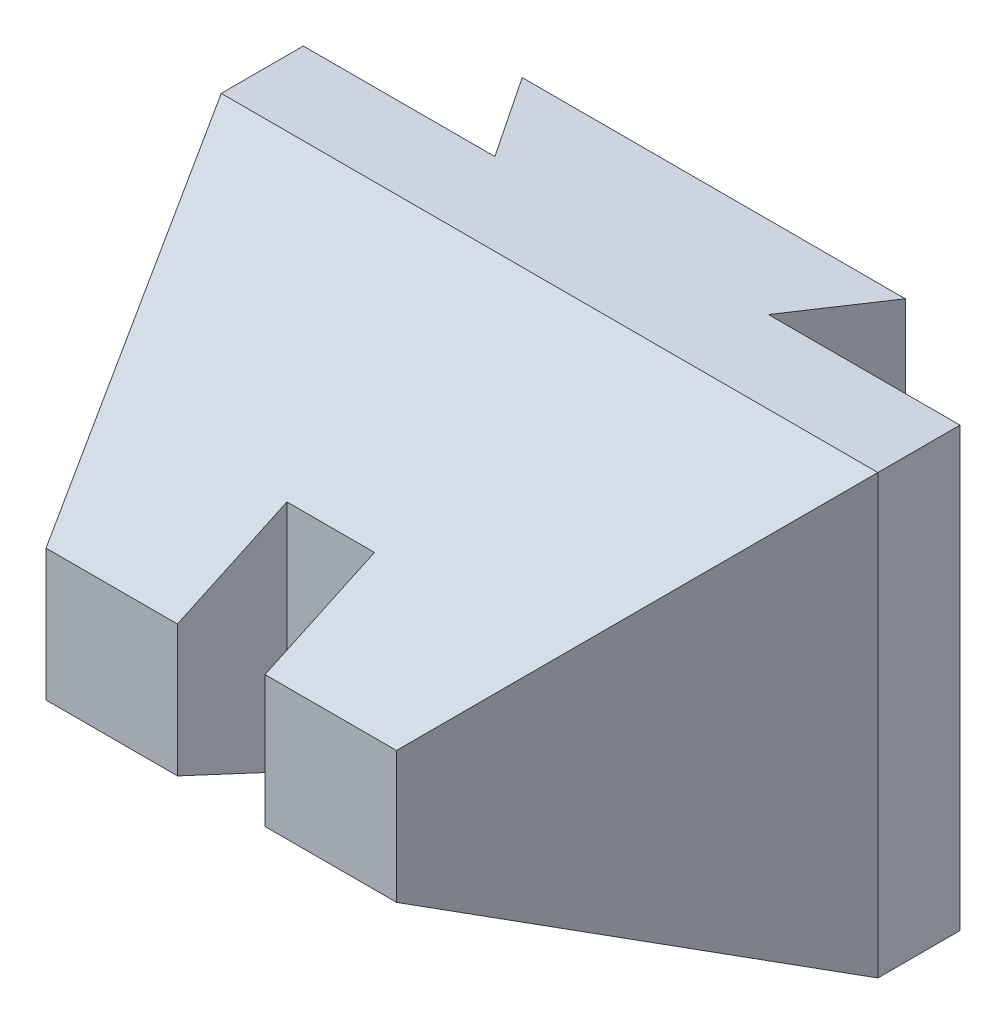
ISO-10303-21;
HEADER;
FILE_DESCRIPTION(('STEP AP214'),'2;1');
FILE_NAME('part.step','',(''),(''),'','','');
FILE_SCHEMA(('AUTOMOTIVE_DESIGN { 1 0 10303 214 1 1 1 1 }'));
ENDSEC;
DATA;
#1=APPLICATION_CONTEXT('core data for automotive mechanical design processes');
#2=APPLICATION_PROTOCOL_DEFINITION('international standard','automotive_design',2000,#1);
#3=PRODUCT_CONTEXT('',#1,'mechanical');
#4=PRODUCT('Part','Part','',(#3));
#5=PRODUCT_RELATED_PRODUCT_CATEGORY('part','',(#4));
#6=PRODUCT_DEFINITION_FORMATION('','',#4);
#7=PRODUCT_DEFINITION_CONTEXT('part definition',#1,'design');
#8=PRODUCT_DEFINITION('design','',#6,#7);
#9=PRODUCT_DEFINITION_SHAPE('','',#8);
#10=(LENGTH_UNIT() NAMED_UNIT(*) SI_UNIT(.MILLI.,.METRE.));
#11=(NAMED_UNIT(*) PLANE_ANGLE_UNIT() SI_UNIT($,.RADIAN.));
#12=(NAMED_UNIT(*) SI_UNIT($,.STERADIAN.) SOLID_ANGLE_UNIT());
#13=UNCERTAINTY_MEASURE_WITH_UNIT(LENGTH_MEASURE(1.E-05),#10,'distance_accuracy_value','');
#14=(GEOMETRIC_REPRESENTATION_CONTEXT(3) GLOBAL_UNCERTAINTY_ASSIGNED_CONTEXT((#13)) GLOBAL_UNIT_ASSIGNED_CONTEXT((#10,
#11,#12)) REPRESENTATION_CONTEXT('',''));
#15=CARTESIAN_POINT('',(0.,0.,0.));
#16=DIRECTION('',(0.,0.,1.));
#17=DIRECTION('',(1.,0.,0.));
#18=AXIS2_PLACEMENT_3D('',#15,#16,#17);
#19=CARTESIAN_POINT('',(-60.,-40.,60.));
#20=DIRECTION('',(0.,0.,1.));
#21=DIRECTION('',(1.,0.,0.));
#22=AXIS2_PLACEMENT_3D('',#19,#20,#21);
#23=PLANE('',#22);
#24=DIRECTION('',(0.,-1.,0.));
#25=VECTOR('',#24,1.);
#26=CARTESIAN_POINT('',(-8.00000000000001,-40.,60.));
#27=LINE('',#26,#25);
#28=CARTESIAN_POINT('',(-8.,12.0215405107,60.));
#29=VERTEX_POINT('',#28);
#30=CARTESIAN_POINT('',(-8.,-12.0215405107,60.));
#31=VERTEX_POINT('',#30);
#32=EDGE_CURVE('E39',#29,#31,#27,.T.);
#33=ORIENTED_EDGE('',*,*,#32,.F.);
#34=DIRECTION('',(1.,0.,0.));
#35=VECTOR('',#34,1.);
#36=CARTESIAN_POINT('',(-60.,12.0215405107,60.));
#37=LINE('',#36,#35);
#38=CARTESIAN_POINT('',(-32.0215405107,12.0215405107,60.));
#39=VERTEX_POINT('',#38);
#40=EDGE_CURVE('E155',#29,#39,#37,.F.);
#41=ORIENTED_EDGE('',*,*,#40,.T.);
#42=DIRECTION('',(0.,1.,0.));
#43=VECTOR('',#42,1.);
#44=CARTESIAN_POINT('',(-32.0215405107,40.,60.));
#45=LINE('',#44,#43);
#46=CARTESIAN_POINT('',(-32.0215405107,-12.0215405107,60.));
#47=VERTEX_POINT('',#46);
#48=EDGE_CURVE('E180',#39,#47,#45,.F.);
#49=ORIENTED_EDGE('',*,*,#48,.T.);
#50=DIRECTION('',(-1.,0.,0.));
#51=VECTOR('',#50,1.);
#52=CARTESIAN_POINT('',(-60.,-12.0215405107,60.));
#53=LINE('',#52,#51);
#54=EDGE_CURVE('E175',#47,#31,#53,.F.);
#55=ORIENTED_EDGE('',*,*,#54,.T.);
#56=EDGE_LOOP('',(#33,#41,#49,#55));
#57=FACE_BOUND('',#56,.T.);
#58=ADVANCED_FACE('F31',(#57),#23,.T.);
#59=CARTESIAN_POINT('',(60.,-40.,-30.));
#60=DIRECTION('',(0.,1.,0.));
#61=DIRECTION('',(-1.,0.,0.));
#62=AXIS2_PLACEMENT_3D('',#59,#60,#61);
#63=PLANE('',#62);
#64=DIRECTION('',(-1.,0.,0.));
#65=VECTOR('',#64,1.);
#66=CARTESIAN_POINT('',(60.,-40.0000000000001,-15.));
#67=LINE('',#66,#65);
#68=CARTESIAN_POINT('',(60.,-40.0000000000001,-15.));
#69=VERTEX_POINT('',#68);
#70=CARTESIAN_POINT('',(25.,-40.,-15.));
#71=VERTEX_POINT('',#70);
#72=EDGE_CURVE('E237',#69,#71,#67,.T.);
#73=ORIENTED_EDGE('',*,*,#72,.F.);
#74=DIRECTION('',(0.,0.,1.));
#75=VECTOR('',#74,1.);
#76=CARTESIAN_POINT('',(60.,-40.,-30.));
#77=LINE('',#76,#75);
#78=CARTESIAN_POINT('',(60.,-40.,0.));
#79=VERTEX_POINT('',#78);
#80=EDGE_CURVE('E208',#69,#79,#77,.T.);
#81=ORIENTED_EDGE('',*,*,#80,.T.);
#82=DIRECTION('',(1.,0.,0.));
#83=VECTOR('',#82,1.);
#84=CARTESIAN_POINT('',(-60.,-40.,0.));
#85=LINE('',#84,#83);
#86=CARTESIAN_POINT('',(-60.,-40.,0.));
#87=VERTEX_POINT('',#86);
#88=EDGE_CURVE('E196',#87,#79,#85,.T.);
#89=ORIENTED_EDGE('',*,*,#88,.F.);
#90=DIRECTION('',(0.,0.,1.));
#91=VECTOR('',#90,1.);
#92=CARTESIAN_POINT('',(-60.,-40.,-30.));
#93=LINE('',#92,#91);
#94=CARTESIAN_POINT('',(-60.,-40.,-15.));
#95=VERTEX_POINT('',#94);
#96=EDGE_CURVE('E202',#95,#87,#93,.T.);
#97=ORIENTED_EDGE('',*,*,#96,.F.);
#98=DIRECTION('',(1.,0.,0.));
#99=VECTOR('',#98,1.);
#100=CARTESIAN_POINT('',(-60.,-40.,-15.));
#101=LINE('',#100,#99);
#102=CARTESIAN_POINT('',(-25.,-40.,-15.));
#103=VERTEX_POINT('',#102);
#104=EDGE_CURVE('E225',#95,#103,#101,.T.);
#105=ORIENTED_EDGE('',*,*,#104,.T.);
#106=DIRECTION('',(-0.554700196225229,0.,-0.832050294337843));
#107=VECTOR('',#106,1.);
#108=CARTESIAN_POINT('',(-25.,-40.,-15.));
#109=LINE('',#108,#107);
#110=CARTESIAN_POINT('',(-35.,-40.,-30.));
#111=VERTEX_POINT('',#110);
#112=EDGE_CURVE('E219',#103,#111,#109,.T.);
#113=ORIENTED_EDGE('',*,*,#112,.T.);
#114=DIRECTION('',(-1.,0.,0.));
#115=VECTOR('',#114,1.);
#116=CARTESIAN_POINT('',(60.,-40.,-30.));
#117=LINE('',#116,#115);
#118=CARTESIAN_POINT('',(35.,-40.,-30.));
#119=VERTEX_POINT('',#118);
#120=EDGE_CURVE('E213',#119,#111,#117,.T.);
#121=ORIENTED_EDGE('',*,*,#120,.F.);
#122=DIRECTION('',(0.554700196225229,0.,-0.832050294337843));
#123=VECTOR('',#122,1.);
#124=CARTESIAN_POINT('',(25.,-40.,-15.));
#125=LINE('',#124,#123);
#126=EDGE_CURVE('E54',#71,#119,#125,.T.);
#127=ORIENTED_EDGE('',*,*,#126,.F.);
#128=EDGE_LOOP('',(#73,#81,#89,#97,#105,#113,#121,#127));
#129=FACE_BOUND('',#128,.T.);
#130=ADVANCED_FACE('F281',(#129),#63,.F.);
#131=CARTESIAN_POINT('',(-60.,40.,-30.));
#132=DIRECTION('',(0.,-1.,0.));
#133=DIRECTION('',(1.,0.,0.));
#134=AXIS2_PLACEMENT_3D('',#131,#132,#133);
#135=PLANE('',#134);
#136=DIRECTION('',(-1.,0.,0.));
#137=VECTOR('',#136,1.);
#138=CARTESIAN_POINT('',(60.,40.,-15.));
#139=LINE('',#138,#137);
#140=CARTESIAN_POINT('',(60.,40.,-15.));
#141=VERTEX_POINT('',#140);
#142=CARTESIAN_POINT('',(25.,40.,-15.));
#143=VERTEX_POINT('',#142);
#144=EDGE_CURVE('E241',#141,#143,#139,.T.);
#145=ORIENTED_EDGE('',*,*,#144,.T.);
#146=DIRECTION('',(0.554700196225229,0.,-0.832050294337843));
#147=VECTOR('',#146,1.);
#148=CARTESIAN_POINT('',(25.,40.,-15.));
#149=LINE('',#148,#147);
#150=CARTESIAN_POINT('',(35.,40.,-30.));
#151=VERTEX_POINT('',#150);
#152=EDGE_CURVE('E244',#143,#151,#149,.T.);
#153=ORIENTED_EDGE('',*,*,#152,.T.);
#154=DIRECTION('',(1.,0.,0.));
#155=VECTOR('',#154,1.);
#156=CARTESIAN_POINT('',(-60.,40.,-30.));
#157=LINE('',#156,#155);
#158=CARTESIAN_POINT('',(-35.,40.,-30.));
#159=VERTEX_POINT('',#158);
#160=EDGE_CURVE('E210',#159,#151,#157,.T.);
#161=ORIENTED_EDGE('',*,*,#160,.F.);
#162=DIRECTION('',(-0.554700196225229,0.,-0.832050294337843));
#163=VECTOR('',#162,1.);
#164=CARTESIAN_POINT('',(-25.,40.,-15.));
#165=LINE('',#164,#163);
#166=CARTESIAN_POINT('',(-25.,40.,-15.));
#167=VERTEX_POINT('',#166);
#168=EDGE_CURVE('E223',#167,#159,#165,.T.);
#169=ORIENTED_EDGE('',*,*,#168,.F.);
#170=DIRECTION('',(1.,0.,0.));
#171=VECTOR('',#170,1.);
#172=CARTESIAN_POINT('',(-60.,40.,-15.));
#173=LINE('',#172,#171);
#174=CARTESIAN_POINT('',(-60.,40.,-15.));
#175=VERTEX_POINT('',#174);
#176=EDGE_CURVE('E226',#175,#167,#173,.T.);
#177=ORIENTED_EDGE('',*,*,#176,.F.);
#178=DIRECTION('',(0.,0.,1.));
#179=VECTOR('',#178,1.);
#180=CARTESIAN_POINT('',(-60.,40.,-30.));
#181=LINE('',#180,#179);
#182=CARTESIAN_POINT('',(-60.,40.,0.));
#183=VERTEX_POINT('',#182);
#184=EDGE_CURVE('E204',#175,#183,#181,.T.);
#185=ORIENTED_EDGE('',*,*,#184,.T.);
#186=DIRECTION('',(-1.,0.,0.));
#187=VECTOR('',#186,1.);
#188=CARTESIAN_POINT('',(-60.,40.,0.));
#189=LINE('',#188,#187);
#190=CARTESIAN_POINT('',(60.,40.,0.));
#191=VERTEX_POINT('',#190);
#192=EDGE_CURVE('E185',#191,#183,#189,.T.);
#193=ORIENTED_EDGE('',*,*,#192,.F.);
#194=DIRECTION('',(0.,0.,1.));
#195=VECTOR('',#194,1.);
#196=CARTESIAN_POINT('',(60.,40.,-30.));
#197=LINE('',#196,#195);
#198=EDGE_CURVE('E206',#141,#191,#197,.T.);
#199=ORIENTED_EDGE('',*,*,#198,.F.);
#200=EDGE_LOOP('',(#145,#153,#161,#169,#177,#185,#193,#199));
#201=FACE_BOUND('',#200,.T.);
#202=ADVANCED_FACE('F273',(#201),#135,.F.);
#203=CARTESIAN_POINT('',(60.,40.,-30.));
#204=DIRECTION('',(-1.,0.,0.));
#205=DIRECTION('',(0.,0.,1.));
#206=AXIS2_PLACEMENT_3D('',#203,#204,#205);
#207=PLANE('',#206);
#208=DIRECTION('',(0.,1.,0.));
#209=VECTOR('',#208,1.);
#210=CARTESIAN_POINT('',(60.,-40.0000000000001,-15.));
#211=LINE('',#210,#209);
#212=EDGE_CURVE('E229',#69,#141,#211,.T.);
#213=ORIENTED_EDGE('',*,*,#212,.T.);
#214=ORIENTED_EDGE('',*,*,#198,.T.);
#215=DIRECTION('',(0.,1.,0.));
#216=VECTOR('',#215,1.);
#217=CARTESIAN_POINT('',(60.,40.,0.));
#218=LINE('',#217,#216);
#219=EDGE_CURVE('E193',#79,#191,#218,.T.);
#220=ORIENTED_EDGE('',*,*,#219,.F.);
#221=ORIENTED_EDGE('',*,*,#80,.F.);
#222=EDGE_LOOP('',(#213,#214,#220,#221));
#223=FACE_BOUND('',#222,.T.);
#224=ADVANCED_FACE('F270',(#223),#207,.F.);
#225=CARTESIAN_POINT('',(-60.,-40.,-30.));
#226=DIRECTION('',(0.,0.,-1.));
#227=DIRECTION('',(-1.,0.,0.));
#228=AXIS2_PLACEMENT_3D('',#225,#226,#227);
#229=PLANE('',#228);
#230=ORIENTED_EDGE('',*,*,#160,.T.);
#231=DIRECTION('',(0.,1.,0.));
#232=VECTOR('',#231,1.);
#233=CARTESIAN_POINT('',(35.,-40.,-30.));
#234=LINE('',#233,#232);
#235=EDGE_CURVE('E234',#119,#151,#234,.T.);
#236=ORIENTED_EDGE('',*,*,#235,.F.);
#237=ORIENTED_EDGE('',*,*,#120,.T.);
#238=DIRECTION('',(0.,1.,0.));
#239=VECTOR('',#238,1.);
#240=CARTESIAN_POINT('',(-35.,-40.,-30.));
#241=LINE('',#240,#239);
#242=EDGE_CURVE('E215',#111,#159,#241,.T.);
#243=ORIENTED_EDGE('',*,*,#242,.T.);
#244=EDGE_LOOP('',(#230,#236,#237,#243));
#245=FACE_BOUND('',#244,.T.);
#246=ADVANCED_FACE('F291',(#245),#229,.T.);
#247=CARTESIAN_POINT('',(-60.,40.,0.));
#248=DIRECTION('',(-0.90630778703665,0.,0.4226182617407));
#249=DIRECTION('',(0.4226182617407,0.,0.90630778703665));
#250=AXIS2_PLACEMENT_3D('',#247,#248,#249);
#251=PLANE('',#250);
#252=DIRECTION('',(0.,-1.,0.));
#253=VECTOR('',#252,1.);
#254=CARTESIAN_POINT('',(-60.,40.,0.));
#255=LINE('',#254,#253);
#256=EDGE_CURVE('E199',#183,#87,#255,.T.);
#257=ORIENTED_EDGE('',*,*,#256,.T.);
#258=DIRECTION('',(-0.389281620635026,-0.389281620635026,-0.834817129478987));
#259=VECTOR('',#258,1.);
#260=CARTESIAN_POINT('',(-60.,-40.,0.));
#261=LINE('',#260,#259);
#262=EDGE_CURVE('E138',#47,#87,#261,.T.);
#263=ORIENTED_EDGE('',*,*,#262,.F.);
#264=ORIENTED_EDGE('',*,*,#48,.F.);
#265=DIRECTION('',(-0.389281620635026,0.389281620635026,-0.834817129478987));
#266=VECTOR('',#265,1.);
#267=CARTESIAN_POINT('',(-60.,40.,0.));
#268=LINE('',#267,#266);
#269=EDGE_CURVE('E154',#39,#183,#268,.T.);
#270=ORIENTED_EDGE('',*,*,#269,.T.);
#271=EDGE_LOOP('',(#257,#263,#264,#270));
#272=FACE_BOUND('',#271,.T.);
#273=ADVANCED_FACE('F259',(#272),#251,.T.);
#274=CARTESIAN_POINT('',(-60.,-40.,0.));
#275=DIRECTION('',(0.,-0.90630778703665,0.4226182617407));
#276=DIRECTION('',(0.,-0.4226182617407,-0.90630778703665));
#277=AXIS2_PLACEMENT_3D('',#274,#275,#276);
#278=PLANE('',#277);
#279=DIRECTION('',(-1.,0.,0.));
#280=VECTOR('',#279,1.);
#281=CARTESIAN_POINT('',(-60.,-21.3476936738,40.));
#282=LINE('',#281,#280);
#283=CARTESIAN_POINT('',(-8.,-21.3476936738,40.));
#284=VERTEX_POINT('',#283);
#285=CARTESIAN_POINT('',(8.,-21.3476936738,40.));
#286=VERTEX_POINT('',#285);
#287=EDGE_CURVE('E177',#284,#286,#282,.F.);
#288=ORIENTED_EDGE('',*,*,#287,.F.);
#289=DIRECTION('',(0.,-0.4226182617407,-0.90630778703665));
#290=VECTOR('',#289,1.);
#291=CARTESIAN_POINT('',(-8.00000000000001,-40.,0.));
#292=LINE('',#291,#290);
#293=EDGE_CURVE('E167',#284,#31,#292,.F.);
#294=ORIENTED_EDGE('',*,*,#293,.T.);
#295=ORIENTED_EDGE('',*,*,#54,.F.);
#296=ORIENTED_EDGE('',*,*,#262,.T.);
#297=ORIENTED_EDGE('',*,*,#88,.T.);
#298=DIRECTION('',(0.389281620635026,-0.389281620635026,-0.834817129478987));
#299=VECTOR('',#298,1.);
#300=CARTESIAN_POINT('',(47.8767855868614,-27.8767855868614,25.9983172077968));
#301=LINE('',#300,#299);
#302=CARTESIAN_POINT('',(32.0215405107,-12.0215405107,60.));
#303=VERTEX_POINT('',#302);
#304=EDGE_CURVE('E186',#303,#79,#301,.T.);
#305=ORIENTED_EDGE('',*,*,#304,.F.);
#306=CARTESIAN_POINT('',(7.99999999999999,-12.0215405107,60.));
#307=VERTEX_POINT('',#306);
#308=EDGE_CURVE('E182',#307,#303,#53,.F.);
#309=ORIENTED_EDGE('',*,*,#308,.F.);
#310=DIRECTION('',(0.,0.4226182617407,0.90630778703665));
#311=VECTOR('',#310,1.);
#312=CARTESIAN_POINT('',(7.99999999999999,-40.,0.));
#313=LINE('',#312,#311);
#314=EDGE_CURVE('E46',#307,#286,#313,.F.);
#315=ORIENTED_EDGE('',*,*,#314,.T.);
#316=EDGE_LOOP('',(#288,#294,#295,#296,#297,#305,#309,#315));
#317=FACE_BOUND('',#316,.T.);
#318=ADVANCED_FACE('F33',(#317),#278,.T.);
#319=CARTESIAN_POINT('',(60.,40.,0.));
#320=DIRECTION('',(0.90630778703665,0.,0.4226182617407));
#321=DIRECTION('',(0.4226182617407,0.,-0.90630778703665));
#322=AXIS2_PLACEMENT_3D('',#319,#320,#321);
#323=PLANE('',#322);
#324=ORIENTED_EDGE('',*,*,#219,.T.);
#325=DIRECTION('',(0.389281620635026,0.389281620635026,-0.834817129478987));
#326=VECTOR('',#325,1.);
#327=CARTESIAN_POINT('',(41.8151783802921,21.8151783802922,38.9974758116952));
#328=LINE('',#327,#326);
#329=CARTESIAN_POINT('',(32.0215405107,12.0215405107,60.));
#330=VERTEX_POINT('',#329);
#331=EDGE_CURVE('E158',#330,#191,#328,.T.);
#332=ORIENTED_EDGE('',*,*,#331,.F.);
#333=DIRECTION('',(0.,-1.,0.));
#334=VECTOR('',#333,1.);
#335=CARTESIAN_POINT('',(32.0215405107,40.,60.));
#336=LINE('',#335,#334);
#337=EDGE_CURVE('E152',#303,#330,#336,.F.);
#338=ORIENTED_EDGE('',*,*,#337,.F.);
#339=ORIENTED_EDGE('',*,*,#304,.T.);
#340=EDGE_LOOP('',(#324,#332,#338,#339));
#341=FACE_BOUND('',#340,.T.);
#342=ADVANCED_FACE('F266',(#341),#323,.T.);
#343=CARTESIAN_POINT('',(-60.,40.,0.));
#344=DIRECTION('',(0.,0.90630778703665,0.4226182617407));
#345=DIRECTION('',(0.,-0.4226182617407,0.90630778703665));
#346=AXIS2_PLACEMENT_3D('',#343,#344,#345);
#347=PLANE('',#346);
#348=ORIENTED_EDGE('',*,*,#40,.F.);
#349=DIRECTION('',(0.,-0.4226182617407,0.90630778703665));
#350=VECTOR('',#349,1.);
#351=CARTESIAN_POINT('',(-8.,40.,0.));
#352=LINE('',#351,#350);
#353=CARTESIAN_POINT('',(-8.,21.3476936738,40.));
#354=VERTEX_POINT('',#353);
#355=EDGE_CURVE('E169',#29,#354,#352,.F.);
#356=ORIENTED_EDGE('',*,*,#355,.T.);
#357=DIRECTION('',(1.,0.,0.));
#358=VECTOR('',#357,1.);
#359=CARTESIAN_POINT('',(-60.,21.3476936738,40.));
#360=LINE('',#359,#358);
#361=CARTESIAN_POINT('',(8.,21.3476936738,40.));
#362=VERTEX_POINT('',#361);
#363=EDGE_CURVE('E11',#362,#354,#360,.F.);
#364=ORIENTED_EDGE('',*,*,#363,.F.);
#365=DIRECTION('',(0.,0.4226182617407,-0.90630778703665));
#366=VECTOR('',#365,1.);
#367=CARTESIAN_POINT('',(7.99999999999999,40.,0.));
#368=LINE('',#367,#366);
#369=CARTESIAN_POINT('',(8.,12.0215405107,60.));
#370=VERTEX_POINT('',#369);
#371=EDGE_CURVE('E133',#362,#370,#368,.F.);
#372=ORIENTED_EDGE('',*,*,#371,.T.);
#373=EDGE_CURVE('E146',#330,#370,#37,.F.);
#374=ORIENTED_EDGE('',*,*,#373,.F.);
#375=ORIENTED_EDGE('',*,*,#331,.T.);
#376=ORIENTED_EDGE('',*,*,#192,.T.);
#377=ORIENTED_EDGE('',*,*,#269,.F.);
#378=EDGE_LOOP('',(#348,#356,#364,#372,#374,#375,#376,#377));
#379=FACE_BOUND('',#378,.T.);
#380=ADVANCED_FACE('F144',(#379),#347,.T.);
#381=DIRECTION('',(0.,1.,0.));
#382=VECTOR('',#381,1.);
#383=CARTESIAN_POINT('',(7.99999999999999,-40.,60.));
#384=LINE('',#383,#382);
#385=EDGE_CURVE('E130',#307,#370,#384,.T.);
#386=ORIENTED_EDGE('',*,*,#385,.F.);
#387=ORIENTED_EDGE('',*,*,#308,.T.);
#388=ORIENTED_EDGE('',*,*,#337,.T.);
#389=ORIENTED_EDGE('',*,*,#373,.T.);
#390=EDGE_LOOP('',(#386,#387,#388,#389));
#391=FACE_BOUND('',#390,.T.);
#392=ADVANCED_FACE('F150',(#391),#23,.T.);
#393=CARTESIAN_POINT('',(-60.,-40.,-30.));
#394=DIRECTION('',(1.,0.,0.));
#395=DIRECTION('',(0.,0.,-1.));
#396=AXIS2_PLACEMENT_3D('',#393,#394,#395);
#397=PLANE('',#396);
#398=ORIENTED_EDGE('',*,*,#184,.F.);
#399=DIRECTION('',(0.,1.,0.));
#400=VECTOR('',#399,1.);
#401=CARTESIAN_POINT('',(-60.,-40.,-15.));
#402=LINE('',#401,#400);
#403=EDGE_CURVE('E216',#95,#175,#402,.T.);
#404=ORIENTED_EDGE('',*,*,#403,.F.);
#405=ORIENTED_EDGE('',*,*,#96,.T.);
#406=ORIENTED_EDGE('',*,*,#256,.F.);
#407=EDGE_LOOP('',(#398,#404,#405,#406));
#408=FACE_BOUND('',#407,.T.);
#409=ADVANCED_FACE('F279',(#408),#397,.F.);
#410=CARTESIAN_POINT('',(-25.,-40.,-15.));
#411=DIRECTION('',(0.832050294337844,0.,-0.554700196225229));
#412=DIRECTION('',(-0.554700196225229,0.,-0.832050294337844));
#413=AXIS2_PLACEMENT_3D('',#410,#411,#412);
#414=PLANE('',#413);
#415=ORIENTED_EDGE('',*,*,#168,.T.);
#416=ORIENTED_EDGE('',*,*,#242,.F.);
#417=ORIENTED_EDGE('',*,*,#112,.F.);
#418=DIRECTION('',(0.,1.,0.));
#419=VECTOR('',#418,1.);
#420=CARTESIAN_POINT('',(-25.,-40.,-15.));
#421=LINE('',#420,#419);
#422=EDGE_CURVE('E218',#103,#167,#421,.T.);
#423=ORIENTED_EDGE('',*,*,#422,.T.);
#424=EDGE_LOOP('',(#415,#416,#417,#423));
#425=FACE_BOUND('',#424,.T.);
#426=ADVANCED_FACE('F288',(#425),#414,.F.);
#427=CARTESIAN_POINT('',(-60.,-40.,-15.));
#428=DIRECTION('',(0.,0.,1.));
#429=DIRECTION('',(1.,0.,0.));
#430=AXIS2_PLACEMENT_3D('',#427,#428,#429);
#431=PLANE('',#430);
#432=ORIENTED_EDGE('',*,*,#176,.T.);
#433=ORIENTED_EDGE('',*,*,#422,.F.);
#434=ORIENTED_EDGE('',*,*,#104,.F.);
#435=ORIENTED_EDGE('',*,*,#403,.T.);
#436=EDGE_LOOP('',(#432,#433,#434,#435));
#437=FACE_BOUND('',#436,.T.);
#438=ADVANCED_FACE('F285',(#437),#431,.F.);
#439=CARTESIAN_POINT('',(60.,-40.0000000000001,-15.));
#440=DIRECTION('',(0.,0.,-1.));
#441=DIRECTION('',(-1.,0.,0.));
#442=AXIS2_PLACEMENT_3D('',#439,#440,#441);
#443=PLANE('',#442);
#444=ORIENTED_EDGE('',*,*,#144,.F.);
#445=ORIENTED_EDGE('',*,*,#212,.F.);
#446=ORIENTED_EDGE('',*,*,#72,.T.);
#447=DIRECTION('',(0.,1.,0.));
#448=VECTOR('',#447,1.);
#449=CARTESIAN_POINT('',(25.,-40.,-15.));
#450=LINE('',#449,#448);
#451=EDGE_CURVE('E236',#71,#143,#450,.T.);
#452=ORIENTED_EDGE('',*,*,#451,.T.);
#453=EDGE_LOOP('',(#444,#445,#446,#452));
#454=FACE_BOUND('',#453,.T.);
#455=ADVANCED_FACE('F295',(#454),#443,.T.);
#456=CARTESIAN_POINT('',(25.,-40.,-15.));
#457=DIRECTION('',(0.832050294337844,0.,0.554700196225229));
#458=DIRECTION('',(0.554700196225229,0.,-0.832050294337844));
#459=AXIS2_PLACEMENT_3D('',#456,#457,#458);
#460=PLANE('',#459);
#461=ORIENTED_EDGE('',*,*,#152,.F.);
#462=ORIENTED_EDGE('',*,*,#451,.F.);
#463=ORIENTED_EDGE('',*,*,#126,.T.);
#464=ORIENTED_EDGE('',*,*,#235,.T.);
#465=EDGE_LOOP('',(#461,#462,#463,#464));
#466=FACE_BOUND('',#465,.T.);
#467=ADVANCED_FACE('F293',(#466),#460,.T.);
#468=CARTESIAN_POINT('',(-8.,-25.,40.));
#469=DIRECTION('',(0.,0.,1.));
#470=DIRECTION('',(1.,0.,0.));
#471=AXIS2_PLACEMENT_3D('',#468,#469,#470);
#472=PLANE('',#471);
#473=ORIENTED_EDGE('',*,*,#287,.T.);
#474=DIRECTION('',(0.,1.,0.));
#475=VECTOR('',#474,1.);
#476=CARTESIAN_POINT('',(8.,25.,40.));
#477=LINE('',#476,#475);
#478=EDGE_CURVE('E148',#286,#362,#477,.T.);
#479=ORIENTED_EDGE('',*,*,#478,.T.);
#480=ORIENTED_EDGE('',*,*,#363,.T.);
#481=DIRECTION('',(0.,-1.,0.));
#482=VECTOR('',#481,1.);
#483=CARTESIAN_POINT('',(-8.,25.,40.));
#484=LINE('',#483,#482);
#485=EDGE_CURVE('E253',#354,#284,#484,.T.);
#486=ORIENTED_EDGE('',*,*,#485,.T.);
#487=EDGE_LOOP('',(#473,#479,#480,#486));
#488=FACE_BOUND('',#487,.T.);
#489=ADVANCED_FACE('F255',(#488),#472,.T.);
#490=CARTESIAN_POINT('',(-8.,25.,40.));
#491=DIRECTION('',(-1.,0.,0.));
#492=DIRECTION('',(0.,-1.,0.));
#493=AXIS2_PLACEMENT_3D('',#490,#491,#492);
#494=PLANE('',#493);
#495=ORIENTED_EDGE('',*,*,#485,.F.);
#496=ORIENTED_EDGE('',*,*,#355,.F.);
#497=ORIENTED_EDGE('',*,*,#32,.T.);
#498=ORIENTED_EDGE('',*,*,#293,.F.);
#499=EDGE_LOOP('',(#495,#496,#497,#498));
#500=FACE_BOUND('',#499,.T.);
#501=ADVANCED_FACE('F166',(#500),#494,.F.);
#502=CARTESIAN_POINT('',(8.,25.,40.));
#503=DIRECTION('',(1.,0.,0.));
#504=DIRECTION('',(0.,1.,0.));
#505=AXIS2_PLACEMENT_3D('',#502,#503,#504);
#506=PLANE('',#505);
#507=ORIENTED_EDGE('',*,*,#385,.T.);
#508=ORIENTED_EDGE('',*,*,#371,.F.);
#509=ORIENTED_EDGE('',*,*,#478,.F.);
#510=ORIENTED_EDGE('',*,*,#314,.F.);
#511=EDGE_LOOP('',(#507,#508,#509,#510));
#512=FACE_BOUND('',#511,.T.);
#513=ADVANCED_FACE('F132',(#512),#506,.F.);
#514=CLOSED_SHELL('',(#58,#130,#202,#224,#246,#273,#318,#342,#380,#392,#409,#426,#438,#455,#467,
#489,#501,#513));
#515=MANIFOLD_SOLID_BREP('B2',#514);
#516=ADVANCED_BREP_SHAPE_REPRESENTATION('',(#18,#515),#14);
#517=SHAPE_DEFINITION_REPRESENTATION(#9,#516);
ENDSEC;
END-ISO-10303-21;
